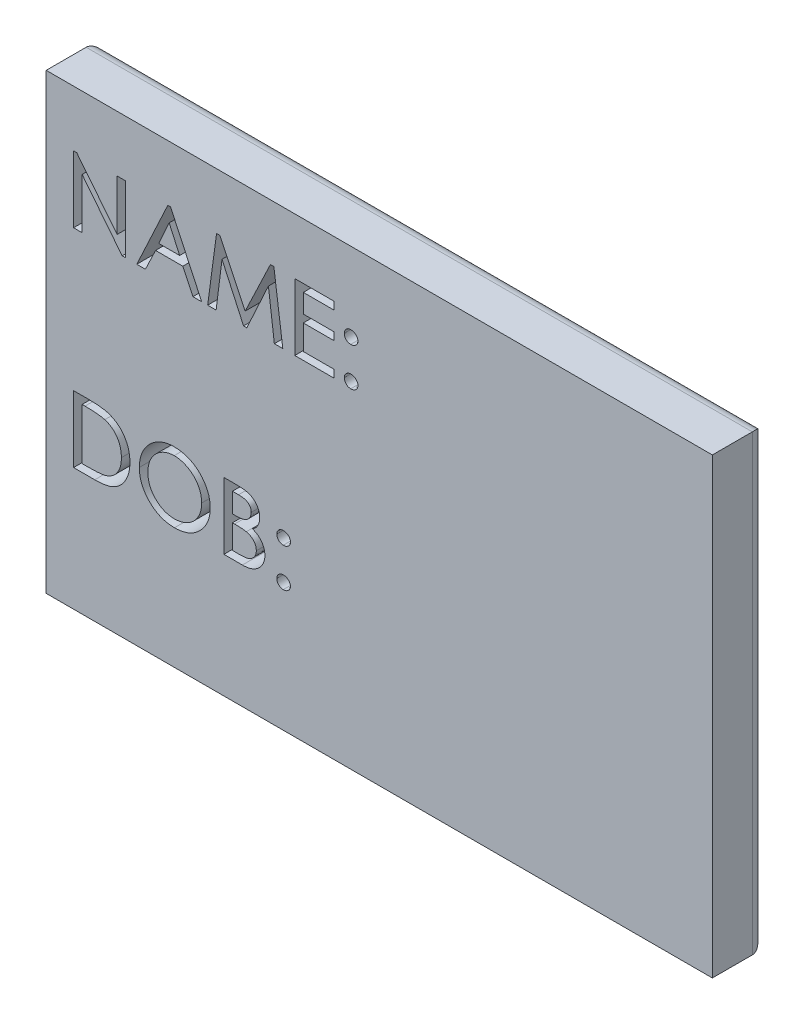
from build123d import *

# Parameters (mm, degrees)
SKETCH1_W           = 31.75
SKETCH1_H           = 21.59
BOSS_EXTRUDE1_DEPTH = 2.54
FILLET1_R           = 0.635
CUT_EXTRUDE1_DEPTH  = 1.905


with BuildPart() as part:
    # Sketch1 → Boss-Extrude1 (new body)
    with BuildSketch(Plane.XY):
        Rectangle(SKETCH1_W, SKETCH1_H)
    extrude(amount=BOSS_EXTRUDE1_DEPTH)

    # Fillet1
    fillet1_edges = [part.edges().sort_by_distance(p)[0] for p in [
        (0, -10.795, 0),
        (-15.875, 0, 0),
        (0, 10.795, 0),
        (15.875, 0, 0),
    ]]
    fillet(fillet1_edges, radius=FILLET1_R)

    # Sketch2 → Cut-Extrude1 (cut)
    # profile 1 of 11: a face of its own
    with BuildSketch(Plane.XY.offset(2.54)):
        Polygon((-14.569923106, 4.948487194), (-14.569923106, 8.123487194), (-14.419186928, 8.123487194), (-12.493961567, 5.71107233), (-12.493961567, 8.123487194), (-12.086910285, 8.123487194), (-12.086910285, 4.948487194), (-12.253546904, 4.948487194), (-14.162871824, 7.354541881), (-14.162871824, 4.948487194), align=None)
    # profile 2 of 11: a face of its own
    with BuildSketch(Plane.XY.offset(2.54)):
        Polygon((-9.949891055, 8.123487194), (-8.464153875, 4.948487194), (-8.882017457, 4.948487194), (-9.364118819, 5.966115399), (-10.662866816, 5.966115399), (-11.144968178, 4.948487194), (-11.557743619, 4.948487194), (-10.07709458, 8.123487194), align=None)
        Polygon((-10.013492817, 7.429591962), (-10.507678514, 6.332461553), (-9.514218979, 6.332461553), align=None, mode=Mode.SUBTRACT)
    # profile 3 of 11: a face of its own
    with BuildSketch(Plane.XY.offset(2.54)):
        Polygon((-8.179217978, 4.948487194), (-7.75499422, 8.123487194), (-7.594717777, 8.123487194), (-6.390736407, 5.599769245), (-5.186755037, 8.123487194), (-5.023934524, 8.123487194), (-4.597166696, 4.948487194), (-5.001037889, 4.948487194), (-5.283429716, 7.187269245), (-6.313778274, 4.948487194), (-6.46769454, 4.948487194), (-7.49486301, 7.187269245), (-7.775982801, 4.948487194), align=None)
    # profile 4 of 11: a face of its own
    with BuildSketch(Plane.XY.offset(2.54)):
        Polygon((-4.027294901, 8.123487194), (-2.154859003, 8.123487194), (-2.154859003, 7.75714104), (-3.620243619, 7.75714104), (-3.620243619, 6.86162822), (-2.154859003, 6.86162822), (-2.154859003, 6.495282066), (-3.620243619, 6.495282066), (-3.620243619, 5.314833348), (-2.154859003, 5.314833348), (-2.154859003, 4.948487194), (-4.027294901, 4.948487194), align=None)
    # profile 5 of 11: a face of its own
    with BuildSketch(Plane.XY.offset(2.54)):
        with BuildLine():
            add(Edge.make_bspline(
                [(-1.361109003, 7.350089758), (-1.336395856, 7.349143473), (-1.288805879, 7.347321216), (-1.221230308, 7.329025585), (-1.161048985, 7.29863509), (-1.110610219, 7.256408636), (-1.06831818, 7.208780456), (-1.038288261, 7.156509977), (-1.017953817, 7.10180968), (-1.016063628, 7.063845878), (-1.015115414, 7.044801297)],
                knots=[0, 0, 0, 0, 1.15701891, 2.228065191, 3.255424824, 4.294461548, 5.295444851, 6.226722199, 7.110433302, 8, 8, 8, 8], degree=3))
            add(Edge.make_bspline(
                [(-1.015115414, 7.044801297), (-1.016102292, 7.025773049), (-1.018079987, 6.987640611), (-1.03792385, 6.932691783), (-1.068780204, 6.880739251), (-1.110133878, 6.832503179), (-1.161316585, 6.791070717), (-1.221189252, 6.760531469), (-1.288817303, 6.742294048), (-1.336399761, 6.740463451), (-1.361109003, 6.739512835)],
                knots=[0, 0, 0, 0, 0.88933384, 1.782217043, 2.704665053, 3.712913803, 4.745427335, 5.772518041, 6.843283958, 8, 8, 8, 8], degree=3))
            add(Edge.make_bspline(
                [(-1.361109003, 6.739512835), (-1.381579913, 6.740605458), (-1.421735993, 6.742748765), (-1.479333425, 6.75990848), (-1.532199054, 6.787879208), (-1.57846636, 6.82657043), (-1.61765397, 6.872784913), (-1.645959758, 6.925646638), (-1.663213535, 6.983747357), (-1.665318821, 7.024117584), (-1.666397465, 7.044801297)],
                knots=[0, 0, 0, 0, 1.02157714, 2.003942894, 2.975565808, 3.991633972, 4.999549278, 5.985507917, 6.967873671, 8, 8, 8, 8], degree=3))
            add(Edge.make_bspline(
                [(-1.666397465, 7.044801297), (-1.665272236, 7.065049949), (-1.663053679, 7.104973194), (-1.646145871, 7.162578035), (-1.617273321, 7.215083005), (-1.578533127, 7.261743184), (-1.532115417, 7.301216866), (-1.479160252, 7.329507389), (-1.421548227, 7.346929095), (-1.38158531, 7.349018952), (-1.361109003, 7.350089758)],
                knots=[0, 0, 0, 0, 1.012462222, 1.996220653, 2.974240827, 3.991749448, 5.016039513, 6.003395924, 6.976974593, 8, 8, 8, 8], degree=3))
        make_face()
    # profile 6 of 11: a face of its own
    with BuildSketch(Plane.XY.offset(2.54)):
        with BuildLine():
            add(Edge.make_bspline(
                [(-1.361109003, 5.518358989), (-1.336395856, 5.517412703), (-1.288805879, 5.515590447), (-1.221230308, 5.497294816), (-1.161048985, 5.466904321), (-1.110610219, 5.424677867), (-1.06831818, 5.377049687), (-1.038288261, 5.324779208), (-1.017953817, 5.270078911), (-1.016063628, 5.232115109), (-1.015115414, 5.213070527)],
                knots=[0, 0, 0, 0, 1.15701891, 2.228065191, 3.255424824, 4.294461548, 5.295444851, 6.226722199, 7.110433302, 8, 8, 8, 8], degree=3))
            add(Edge.make_bspline(
                [(-1.015115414, 5.213070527), (-1.016149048, 5.194264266), (-1.018217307, 5.156633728), (-1.037439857, 5.101843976), (-1.067934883, 5.049692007), (-1.109745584, 5.001523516), (-1.160264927, 4.95909108), (-1.221052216, 4.929680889), (-1.288480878, 4.910368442), (-1.336373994, 4.90866291), (-1.361109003, 4.907782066)],
                knots=[0, 0, 0, 0, 0.879435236, 1.759712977, 2.690738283, 3.698978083, 4.737733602, 5.760330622, 6.843294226, 8, 8, 8, 8], degree=3))
            add(Edge.make_bspline(
                [(-1.361109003, 4.907782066), (-1.381570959, 4.908890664), (-1.421709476, 4.91106531), (-1.479531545, 4.928026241), (-1.531989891, 4.956936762), (-1.578725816, 4.995439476), (-1.617462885, 5.042289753), (-1.645847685, 5.094992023), (-1.66322822, 5.152638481), (-1.665323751, 5.192596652), (-1.666397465, 5.213070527)],
                knots=[0, 0, 0, 0, 1.022542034, 2.005835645, 2.98339371, 4.000421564, 5.017449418, 6.004339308, 6.977457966, 8, 8, 8, 8], degree=3))
            add(Edge.make_bspline(
                [(-1.666397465, 5.213070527), (-1.665309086, 5.233748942), (-1.6631848, 5.274108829), (-1.646121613, 5.332103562), (-1.617439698, 5.384540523), (-1.578505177, 5.430702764), (-1.531917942, 5.469447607), (-1.479180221, 5.497803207), (-1.421542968, 5.515191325), (-1.381583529, 5.517285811), (-1.361109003, 5.518358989)],
                knots=[0, 0, 0, 0, 1.03279153, 2.015790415, 2.993055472, 4.001620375, 5.018343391, 6.004937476, 6.977764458, 8, 8, 8, 8], degree=3))
        make_face()
    # profile 7 of 11: a face of its own
    with BuildSketch(Plane.XY.offset(2.54)):
        with BuildLine():
            Line((-14.569923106, -4.948487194), (-14.569923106, -1.773487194))
            Line((-14.569923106, -1.773487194), (-13.897652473, -1.773487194))
            add(Edge.make_bspline(
                [(-13.897652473, -1.773487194), (-13.841042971, -1.773881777), (-13.732040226, -1.774641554), (-13.574460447, -1.779624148), (-13.429136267, -1.78819181), (-13.295756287, -1.801105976), (-13.17445451, -1.816294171), (-13.065269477, -1.836387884), (-12.967783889, -1.858048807), (-12.908089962, -1.877968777), (-12.880024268, -1.887334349)],
                knots=[0, 0, 0, 0, 1.321377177, 2.544338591, 3.679698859, 4.71869479, 5.671952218, 6.531967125, 7.309789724, 8, 8, 8, 8], degree=3))
            add(Edge.make_bspline(
                [(-12.880024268, -1.887334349), (-12.840729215, -1.902141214), (-12.76317101, -1.93136611), (-12.653281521, -1.986225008), (-12.549462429, -2.046411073), (-12.453007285, -2.114729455), (-12.36410028, -2.190749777), (-12.281215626, -2.272811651), (-12.206910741, -2.363307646), (-12.138847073, -2.459683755), (-12.078539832, -2.562051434), (-12.026338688, -2.669066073), (-11.982250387, -2.780522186), (-11.945991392, -2.896136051), (-11.918202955, -3.016115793), (-11.897668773, -3.140134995), (-11.885399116, -3.268514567), (-11.88406177, -3.355660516), (-11.883384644, -3.399784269)],
                knots=[0, 0, 0, 0, 1.037989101, 2.048720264, 3.03347809, 4.003905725, 4.967380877, 5.923996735, 6.884742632, 7.859453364, 8.839691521, 9.819957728, 10.801471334, 11.80152298, 12.813966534, 13.844978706, 14.908869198, 16, 16, 16, 16], degree=3))
            add(Edge.make_bspline(
                [(-11.883384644, -3.399784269), (-11.883976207, -3.437966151), (-11.885144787, -3.513391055), (-11.895029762, -3.625097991), (-11.910673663, -3.73366983), (-11.933034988, -3.839036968), (-11.961626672, -3.941050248), (-11.996851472, -4.039996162), (-12.037915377, -4.136000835), (-12.085789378, -4.22797069), (-12.138266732, -4.315629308), (-12.195639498, -4.397714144), (-12.256764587, -4.474252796), (-12.321782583, -4.5452529), (-12.391298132, -4.610338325), (-12.465220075, -4.669459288), (-12.543111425, -4.723220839), (-12.625725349, -4.771252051), (-12.714605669, -4.813955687), (-12.811390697, -4.84979798), (-12.916271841, -4.880115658), (-13.029144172, -4.905892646), (-13.150600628, -4.924243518), (-13.280039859, -4.938132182), (-13.41753503, -4.94748052), (-13.511997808, -4.948145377), (-13.56056313, -4.948487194)],
                knots=[0, 0, 0, 0, 1.058131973, 2.090245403, 3.105765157, 4.096918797, 5.07359586, 6.040054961, 7.006085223, 7.965371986, 8.911666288, 9.835956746, 10.738988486, 11.624821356, 12.502036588, 13.375701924, 14.24610047, 15.122941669, 16.021834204, 16.975760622, 17.979893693, 19.046217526, 20.182340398, 21.382202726, 22.654134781, 24, 24, 24, 24], degree=3))
            Line((-13.56056313, -4.948487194), (-14.569923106, -4.948487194))
        make_face()
        with BuildLine():
            Line((-14.162871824, -4.58214104), (-13.886840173, -4.58214104))
            add(Edge.make_bspline(
                [(-13.886840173, -4.58214104), (-13.835954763, -4.581945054), (-13.738196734, -4.581568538), (-13.597632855, -4.577394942), (-13.46927143, -4.57241175), (-13.353524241, -4.563159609), (-13.250137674, -4.552833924), (-13.159109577, -4.539491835), (-13.080067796, -4.524488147), (-13.032371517, -4.510398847), (-13.010407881, -4.503910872)],
                knots=[0, 0, 0, 0, 1.383618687, 2.658126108, 3.823786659, 4.876093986, 5.815132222, 6.648351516, 7.377580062, 8, 8, 8, 8], degree=3))
            add(Edge.make_bspline(
                [(-13.010407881, -4.503910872), (-12.983106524, -4.494150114), (-12.929177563, -4.474869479), (-12.851903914, -4.438991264), (-12.779076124, -4.397605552), (-12.710938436, -4.350339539), (-12.646915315, -4.297814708), (-12.586955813, -4.240090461), (-12.53212613, -4.175979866), (-12.482087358, -4.106757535), (-12.436746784, -4.032894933), (-12.397338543, -3.954633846), (-12.364004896, -3.872132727), (-12.337689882, -3.785591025), (-12.316422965, -3.695118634), (-12.301290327, -3.600550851), (-12.292359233, -3.50171937), (-12.291084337, -3.434571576), (-12.290435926, -3.400420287)],
                knots=[0, 0, 0, 0, 0.982760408, 1.941267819, 2.884666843, 3.819923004, 4.749609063, 5.690155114, 6.638335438, 7.60609908, 8.583824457, 9.574050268, 10.573936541, 11.597196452, 12.638231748, 13.723193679, 14.842018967, 16, 16, 16, 16], degree=3))
            add(Edge.make_bspline(
                [(-12.290435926, -3.400420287), (-12.290946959, -3.364561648), (-12.291953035, -3.293966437), (-12.302871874, -3.190163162), (-12.318132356, -3.090137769), (-12.34111674, -2.994186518), (-12.371402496, -2.902607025), (-12.406546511, -2.814362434), (-12.449672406, -2.7308125), (-12.498447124, -2.651416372), (-12.552938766, -2.577001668), (-12.613170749, -2.508704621), (-12.678031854, -2.44579875), (-12.749093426, -2.390181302), (-12.824339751, -2.339201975), (-12.905317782, -2.295725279), (-12.991143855, -2.257554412), (-13.051135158, -2.237700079), (-13.081641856, -2.22760378)],
                knots=[0, 0, 0, 0, 1.129217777, 2.223100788, 3.284889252, 4.31516385, 5.326848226, 6.321524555, 7.304244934, 8.284784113, 9.254596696, 10.205833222, 11.15055266, 12.096616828, 13.045035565, 14.010353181, 14.988227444, 16, 16, 16, 16], degree=3))
            add(Edge.make_bspline(
                [(-13.081641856, -2.22760378), (-13.107431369, -2.220509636), (-13.162213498, -2.205440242), (-13.251504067, -2.188040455), (-13.352121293, -2.173124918), (-13.46453048, -2.160341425), (-13.588220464, -2.151012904), (-13.72376755, -2.145168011), (-13.870692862, -2.140257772), (-13.972697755, -2.139978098), (-14.025492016, -2.139833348)],
                knots=[0, 0, 0, 0, 0.675026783, 1.433893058, 2.294494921, 3.24250292, 4.28921909, 5.425097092, 6.667317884, 8, 8, 8, 8], degree=3))
            Line((-14.025492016, -2.139833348), (-14.162871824, -2.139833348))
            Line((-14.162871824, -2.139833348), (-14.162871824, -4.58214104))
        make_face(mode=Mode.SUBTRACT)
    # profile 8 of 11: a face of its own
    with BuildSketch(Plane.XY.offset(2.54)):
        with BuildLine():
            add(Edge.make_bspline(
                [(-9.786434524, -1.692076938), (-9.725513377, -1.693483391), (-9.605771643, -1.696247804), (-9.430111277, -1.719817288), (-9.262361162, -1.757523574), (-9.10276873, -1.8113816), (-8.951226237, -1.880390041), (-8.807494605, -1.96468152), (-8.672000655, -2.064511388), (-8.546400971, -2.178599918), (-8.432309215, -2.302876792), (-8.33119947, -2.434245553), (-8.247239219, -2.573287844), (-8.177052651, -2.71799164), (-8.123945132, -2.86969937), (-8.08459815, -3.027125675), (-8.061392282, -3.191325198), (-8.058546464, -3.303036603), (-8.057102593, -3.359715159)],
                knots=[0, 0, 0, 0, 1.090651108, 2.14369656, 3.167927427, 4.165692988, 5.154576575, 6.145033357, 7.14440862, 8.163220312, 9.178978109, 10.162394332, 11.12677451, 12.082874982, 13.037579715, 13.999894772, 14.985214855, 16, 16, 16, 16], degree=3))
            add(Edge.make_bspline(
                [(-8.057102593, -3.359715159), (-8.058518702, -3.415976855), (-8.061309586, -3.526858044), (-8.084961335, -3.690056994), (-8.123091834, -3.847292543), (-8.176490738, -3.998870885), (-8.246540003, -4.143635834), (-8.33092017, -4.282801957), (-8.431421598, -4.415039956), (-8.545087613, -4.540186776), (-8.669998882, -4.654684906), (-8.804120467, -4.755239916), (-8.945825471, -4.839875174), (-9.094407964, -4.910330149), (-9.251083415, -4.963225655), (-9.414681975, -5.002449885), (-9.585847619, -5.025624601), (-9.702410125, -5.028457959), (-9.761629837, -5.02989745)],
                knots=[0, 0, 0, 0, 1.015667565, 2.001689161, 2.971180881, 3.933912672, 4.898051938, 5.870540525, 6.8683264, 7.892867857, 8.919988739, 9.923897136, 10.914753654, 11.896185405, 12.887840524, 13.895451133, 14.930781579, 16, 16, 16, 16], degree=3))
            add(Edge.make_bspline(
                [(-9.761629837, -5.02989745), (-9.819377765, -5.028501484), (-9.933008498, -5.025754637), (-10.099706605, -5.001960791), (-10.259639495, -4.964867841), (-10.412600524, -4.911558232), (-10.558832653, -4.843562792), (-10.697502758, -4.759216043), (-10.829836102, -4.660978), (-10.953315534, -4.548437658), (-11.066007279, -4.425199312), (-11.164855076, -4.294016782), (-11.248925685, -4.156558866), (-11.317315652, -4.012668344), (-11.370593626, -3.862208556), (-11.407552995, -3.705215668), (-11.43147955, -3.542137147), (-11.434231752, -3.431246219), (-11.435628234, -3.374979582)],
                knots=[0, 0, 0, 0, 1.056734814, 2.079339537, 3.076314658, 4.058285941, 5.039336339, 6.023146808, 7.024524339, 8.052147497, 9.076900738, 10.077495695, 11.054668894, 12.021676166, 12.988994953, 13.970866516, 14.970407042, 16, 16, 16, 16], degree=3))
            add(Edge.make_bspline(
                [(-11.435628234, -3.374979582), (-11.43514369, -3.337212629), (-11.434180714, -3.262155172), (-11.422570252, -3.150700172), (-11.405756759, -3.041025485), (-11.381533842, -2.933500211), (-11.350290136, -2.828105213), (-11.311780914, -2.725061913), (-11.267673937, -2.62349939), (-11.215064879, -2.525433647), (-11.157946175, -2.430295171), (-11.094474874, -2.340639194), (-11.027336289, -2.255373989), (-10.953703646, -2.176775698), (-10.876038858, -2.102540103), (-10.793072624, -2.033812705), (-10.705313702, -1.969972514), (-10.612383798, -1.91244122), (-10.516572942, -1.860408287), (-10.417806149, -1.815757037), (-10.317424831, -1.777433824), (-10.214958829, -1.746372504), (-10.110680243, -1.721850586), (-10.004361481, -1.705152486), (-9.896087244, -1.693518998), (-9.823142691, -1.692559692), (-9.786434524, -1.692076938)],
                knots=[0, 0, 0, 0, 1.036913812, 2.060746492, 3.074578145, 4.08324605, 5.085523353, 6.091481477, 7.103103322, 8.124200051, 9.145827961, 10.149052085, 11.139400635, 12.124186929, 13.104469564, 14.088618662, 15.081002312, 16.082788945, 17.088477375, 18.073521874, 19.057670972, 20.037642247, 21.012252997, 21.997331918, 22.992189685, 24, 24, 24, 24], degree=3))
        make_face()
        with BuildLine():
            add(Edge.make_bspline(
                [(-9.773078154, -2.058423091), (-9.799814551, -2.058846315), (-9.85299384, -2.059688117), (-9.932216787, -2.06849962), (-10.010619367, -2.081735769), (-10.08833738, -2.100351), (-10.165434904, -2.123611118), (-10.241248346, -2.153367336), (-10.316510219, -2.187413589), (-10.389878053, -2.227771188), (-10.461399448, -2.271579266), (-10.529048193, -2.320485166), (-10.593600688, -2.372470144), (-10.654126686, -2.429285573), (-10.710512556, -2.490187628), (-10.763071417, -2.555076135), (-10.812204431, -2.623726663), (-10.856835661, -2.696615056), (-10.898057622, -2.772232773), (-10.932757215, -2.851069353), (-10.962150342, -2.93228599), (-10.986274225, -3.015797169), (-11.005602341, -3.101768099), (-11.018533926, -3.19023065), (-11.027373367, -3.281093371), (-11.028171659, -3.342520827), (-11.028576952, -3.373707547)],
                knots=[0, 0, 0, 0, 0.951425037, 1.892405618, 2.834142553, 3.780555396, 4.735506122, 5.698386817, 6.677778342, 7.674036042, 8.677244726, 9.661625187, 10.643485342, 11.625954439, 12.613944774, 13.595804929, 14.596853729, 15.616869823, 16.636634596, 17.660413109, 18.67984269, 19.709280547, 20.753005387, 21.813969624, 22.890152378, 24, 24, 24, 24], degree=3))
            add(Edge.make_bspline(
                [(-11.028576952, -3.373707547), (-11.027592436, -3.41914166), (-11.025661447, -3.508254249), (-11.00703893, -3.638965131), (-10.978167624, -3.763868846), (-10.937301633, -3.882838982), (-10.88468233, -3.995839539), (-10.820280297, -4.102837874), (-10.743987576, -4.204102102), (-10.65671435, -4.297686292), (-10.562101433, -4.383196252), (-10.461745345, -4.457708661), (-10.357943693, -4.522141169), (-10.249030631, -4.5737858), (-10.136073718, -4.614033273), (-10.018881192, -4.642672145), (-9.897431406, -4.660379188), (-9.814903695, -4.662484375), (-9.773078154, -4.663551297)],
                knots=[0, 0, 0, 0, 1.087324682, 2.132633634, 3.154656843, 4.153212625, 5.138884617, 6.133989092, 7.13811672, 8.169089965, 9.193543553, 10.187520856, 11.158295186, 12.114249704, 13.068004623, 14.02467326, 14.998892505, 16, 16, 16, 16], degree=3))
            add(Edge.make_bspline(
                [(-9.773078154, -4.663551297), (-9.743376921, -4.663126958), (-9.684492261, -4.662285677), (-9.597202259, -4.653597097), (-9.511639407, -4.640200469), (-9.42775329, -4.62216637), (-9.345793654, -4.597293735), (-9.265142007, -4.568679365), (-9.186683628, -4.532994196), (-9.109854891, -4.493516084), (-9.036617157, -4.448114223), (-8.966145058, -4.399848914), (-8.899862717, -4.347332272), (-8.839041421, -4.289514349), (-8.781201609, -4.229014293), (-8.727913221, -4.164134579), (-8.678803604, -4.095298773), (-8.634365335, -4.022727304), (-8.594505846, -3.947289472), (-8.559077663, -3.869544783), (-8.530281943, -3.789378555), (-8.505572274, -3.707574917), (-8.487353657, -3.62329901), (-8.474180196, -3.537060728), (-8.465385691, -3.448726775), (-8.464567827, -3.38920524), (-8.464153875, -3.359079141)],
                knots=[0, 0, 0, 0, 1.036970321, 2.055862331, 3.060095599, 4.060719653, 5.049301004, 6.049377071, 7.046955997, 8.056986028, 9.063944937, 10.053856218, 11.039021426, 12.013303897, 12.982198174, 13.960523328, 14.942567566, 15.933032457, 16.929951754, 17.920776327, 18.913894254, 19.902475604, 20.903099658, 21.921964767, 22.948227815, 24, 24, 24, 24], degree=3))
            add(Edge.make_bspline(
                [(-8.464153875, -3.359079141), (-8.464569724, -3.329165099), (-8.465391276, -3.27006682), (-8.474136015, -3.182573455), (-8.487338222, -3.097390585), (-8.50568493, -3.01420919), (-8.530156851, -2.933393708), (-8.559100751, -2.854325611), (-8.594507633, -2.777846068), (-8.634389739, -2.703692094), (-8.678914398, -2.632083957), (-8.728593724, -2.564364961), (-8.782062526, -2.499751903), (-8.840112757, -2.439196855), (-8.902782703, -2.38247915), (-8.969477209, -2.329173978), (-9.040397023, -2.279075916), (-9.115717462, -2.233959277), (-9.193427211, -2.192504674), (-9.273112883, -2.157152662), (-9.353396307, -2.126212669), (-9.43501773, -2.101356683), (-9.517961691, -2.082404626), (-9.602022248, -2.068264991), (-9.687250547, -2.059765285), (-9.744438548, -2.058870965), (-9.773078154, -2.058423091)],
                knots=[0, 0, 0, 0, 1.048789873, 2.071992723, 3.080474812, 4.070813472, 5.056451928, 6.039816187, 7.021295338, 8.009314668, 8.991328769, 9.975844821, 10.952581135, 11.930703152, 12.91499457, 13.914777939, 14.923479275, 15.957618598, 16.991998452, 18.010408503, 19.012925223, 20.00783076, 20.999814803, 21.994803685, 22.995802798, 24, 24, 24, 24], degree=3))
        make_face(mode=Mode.SUBTRACT)
    # profile 9 of 11: a face of its own
    with BuildSketch(Plane.XY.offset(2.54)):
        with BuildLine():
            Line((-7.405820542, -1.773487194), (-6.760898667, -1.773487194))
            add(Edge.make_bspline(
                [(-6.760898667, -1.773487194), (-6.72930101, -1.773595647), (-6.667968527, -1.773806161), (-6.578675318, -1.779314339), (-6.494686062, -1.786896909), (-6.415781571, -1.796451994), (-6.342475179, -1.810897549), (-6.274360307, -1.826972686), (-6.211631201, -1.846717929), (-6.136306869, -1.87696629), (-6.050155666, -1.921566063), (-5.958840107, -1.988557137), (-5.879420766, -2.066987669), (-5.813728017, -2.156603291), (-5.76175875, -2.253820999), (-5.723574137, -2.355944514), (-5.700727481, -2.462346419), (-5.697717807, -2.534692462), (-5.696205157, -2.5710533)],
                knots=[0, 0, 0, 0, 1.007958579, 1.956493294, 2.853051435, 3.69876748, 4.490758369, 5.235590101, 5.930857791, 6.586533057, 7.824014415, 9.014592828, 10.186442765, 11.371570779, 12.545761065, 13.692928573, 14.840474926, 16, 16, 16, 16], degree=3))
            add(Edge.make_bspline(
                [(-5.696205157, -2.5710533), (-5.697503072, -2.605049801), (-5.700068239, -2.672239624), (-5.718294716, -2.771303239), (-5.74888654, -2.866450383), (-5.791581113, -2.956194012), (-5.843168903, -3.03905937), (-5.906748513, -3.109654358), (-5.978225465, -3.16979045), (-6.032704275, -3.198861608), (-6.06000724, -3.213431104)],
                knots=[0, 0, 0, 0, 1.049068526, 2.073352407, 3.097740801, 4.125217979, 5.134529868, 6.0985968, 7.047080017, 8, 8, 8, 8], degree=3))
            add(Edge.make_bspline(
                [(-6.06000724, -3.213431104), (-6.027526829, -3.224215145), (-5.964330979, -3.245197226), (-5.875832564, -3.287067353), (-5.795707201, -3.335895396), (-5.724741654, -3.392989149), (-5.662537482, -3.456331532), (-5.607087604, -3.524147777), (-5.559813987, -3.597495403), (-5.521382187, -3.676082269), (-5.489680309, -3.757798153), (-5.468540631, -3.843112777), (-5.45441023, -3.930600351), (-5.452791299, -3.989952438), (-5.451974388, -4.019901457)],
                knots=[0, 0, 0, 0, 1.133419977, 2.205250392, 3.236826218, 4.236512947, 5.215313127, 6.174419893, 7.135300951, 8.100002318, 9.069604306, 10.034177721, 11.008047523, 12, 12, 12, 12], degree=3))
            add(Edge.make_bspline(
                [(-5.451974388, -4.019901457), (-5.452825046, -4.05089832), (-5.45450534, -4.112125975), (-5.468030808, -4.202421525), (-5.491342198, -4.289171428), (-5.522312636, -4.373260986), (-5.563538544, -4.453633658), (-5.613400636, -4.530966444), (-5.672377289, -4.604916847), (-5.739229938, -4.675184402), (-5.814153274, -4.739543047), (-5.896355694, -4.795495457), (-5.985065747, -4.842958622), (-6.080265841, -4.881972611), (-6.18249919, -4.911492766), (-6.290970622, -4.933186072), (-6.405910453, -4.945901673), (-6.484623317, -4.947611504), (-6.524936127, -4.948487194)],
                knots=[0, 0, 0, 0, 0.936774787, 1.85039767, 2.752028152, 3.648404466, 4.554125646, 5.47676296, 6.425627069, 7.40928418, 8.404729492, 9.405524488, 10.409085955, 11.440939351, 12.509690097, 13.620780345, 14.781482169, 16, 16, 16, 16], degree=3))
            Line((-6.524936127, -4.948487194), (-7.405820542, -4.948487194))
            Line((-7.405820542, -4.948487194), (-7.405820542, -1.773487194))
        make_face()
        with BuildLine():
            Line((-6.99876926, -2.139833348), (-6.99876926, -3.076051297))
            Line((-6.99876926, -3.076051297), (-6.896370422, -3.076051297))
            add(Edge.make_bspline(
                [(-6.896370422, -3.076051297), (-6.869864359, -3.076071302), (-6.818950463, -3.07610973), (-6.745384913, -3.072450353), (-6.677485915, -3.068358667), (-6.615080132, -3.062130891), (-6.55849394, -3.053682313), (-6.507137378, -3.04463325), (-6.461760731, -3.032508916), (-6.409102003, -3.014972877), (-6.350847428, -2.98712282), (-6.288059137, -2.946137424), (-6.233328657, -2.896545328), (-6.187207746, -2.83924941), (-6.149357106, -2.776511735), (-6.122701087, -2.709230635), (-6.105869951, -2.638660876), (-6.104136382, -2.59044107), (-6.103256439, -2.565965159)],
                knots=[0, 0, 0, 0, 1.189795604, 2.285406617, 3.306016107, 4.243629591, 5.09972607, 5.874440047, 6.583200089, 7.20625147, 8.364329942, 9.470433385, 10.562068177, 11.665054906, 12.761988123, 13.838370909, 14.902777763, 16, 16, 16, 16], degree=3))
            add(Edge.make_bspline(
                [(-6.103256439, -2.565965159), (-6.103483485, -2.549819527), (-6.103927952, -2.518212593), (-6.111463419, -2.472491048), (-6.121952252, -2.4289988), (-6.138032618, -2.388600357), (-6.157869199, -2.350524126), (-6.182203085, -2.315060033), (-6.211789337, -2.282915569), (-6.24497277, -2.252497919), (-6.283511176, -2.225485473), (-6.327843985, -2.202973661), (-6.37726263, -2.182800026), (-6.432667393, -2.167565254), (-6.49355577, -2.154531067), (-6.560136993, -2.146003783), (-6.632344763, -2.140987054), (-6.682235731, -2.140227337), (-6.708109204, -2.139833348)],
                knots=[0, 0, 0, 0, 0.920588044, 1.802157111, 2.638793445, 3.470424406, 4.277107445, 5.086238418, 5.917516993, 6.765890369, 7.652348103, 8.594329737, 9.598999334, 10.694623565, 11.869668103, 13.151790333, 14.522917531, 16, 16, 16, 16], degree=3))
            Line((-6.708109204, -2.139833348), (-6.99876926, -2.139833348))
        make_face(mode=Mode.SUBTRACT)
        with BuildLine():
            Line((-6.99876926, -3.44239745), (-6.99876926, -4.58214104))
            Line((-6.99876926, -4.58214104), (-6.687120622, -4.58214104))
            add(Edge.make_bspline(
                [(-6.687120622, -4.58214104), (-6.659771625, -4.581784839), (-6.606970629, -4.581097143), (-6.530793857, -4.579010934), (-6.460381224, -4.573730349), (-6.395879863, -4.566889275), (-6.336966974, -4.558343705), (-6.284447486, -4.546656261), (-6.237252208, -4.534310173), (-6.182932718, -4.514140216), (-6.122139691, -4.482858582), (-6.056038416, -4.437547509), (-5.998648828, -4.382107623), (-5.949249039, -4.319405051), (-5.909032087, -4.251030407), (-5.880401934, -4.178719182), (-5.862235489, -4.103897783), (-5.860099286, -4.053075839), (-5.85902567, -4.027533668)],
                knots=[0, 0, 0, 0, 1.163785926, 2.246848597, 3.241725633, 4.167152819, 5.00659376, 5.772700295, 6.455464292, 7.08048881, 8.234268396, 9.355318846, 10.478218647, 11.615125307, 12.742977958, 13.840148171, 14.914498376, 16, 16, 16, 16], degree=3))
            add(Edge.make_bspline(
                [(-5.85902567, -4.027533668), (-5.860301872, -3.995560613), (-5.862808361, -3.932764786), (-5.888358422, -3.842330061), (-5.92831627, -3.758043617), (-5.984086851, -3.681099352), (-6.053721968, -3.612605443), (-6.136897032, -3.555688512), (-6.232415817, -3.510673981), (-6.301564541, -3.490821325), (-6.337310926, -3.480558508)],
                knots=[0, 0, 0, 0, 0.973192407, 1.911372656, 2.842841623, 3.806662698, 4.794486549, 5.808057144, 6.866876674, 8, 8, 8, 8], degree=3))
            add(Edge.make_bspline(
                [(-6.337310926, -3.480558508), (-6.352121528, -3.477421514), (-6.383920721, -3.47068621), (-6.43581339, -3.463598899), (-6.494687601, -3.456192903), (-6.561167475, -3.451784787), (-6.634904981, -3.446794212), (-6.716162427, -3.444923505), (-6.804771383, -3.442641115), (-6.866263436, -3.442480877), (-6.898278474, -3.44239745)],
                knots=[0, 0, 0, 0, 0.644909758, 1.384657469, 2.230684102, 3.173004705, 4.222865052, 5.379792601, 6.635823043, 8, 8, 8, 8], degree=3))
            Line((-6.898278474, -3.44239745), (-6.99876926, -3.44239745))
        make_face(mode=Mode.SUBTRACT)
    # profile 10 of 11: a face of its own
    with BuildSketch(Plane.XY.offset(2.54)):
        with BuildLine():
            add(Edge.make_bspline(
                [(-4.576814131, -2.54688463), (-4.552100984, -2.547830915), (-4.504511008, -2.549653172), (-4.436935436, -2.567948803), (-4.376754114, -2.598339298), (-4.326315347, -2.640565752), (-4.284023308, -2.688193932), (-4.25399339, -2.74046441), (-4.233658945, -2.795164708), (-4.231768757, -2.83312851), (-4.230820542, -2.852173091)],
                knots=[0, 0, 0, 0, 1.15701891, 2.228065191, 3.255424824, 4.294461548, 5.295444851, 6.226722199, 7.110433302, 8, 8, 8, 8], degree=3))
            add(Edge.make_bspline(
                [(-4.230820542, -2.852173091), (-4.23180742, -2.871201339), (-4.233785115, -2.909333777), (-4.253628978, -2.964282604), (-4.284485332, -3.016235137), (-4.325839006, -3.064471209), (-4.377021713, -3.10590367), (-4.43689438, -3.136442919), (-4.504522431, -3.15468034), (-4.552104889, -3.156510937), (-4.576814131, -3.157461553)],
                knots=[0, 0, 0, 0, 0.88933384, 1.782217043, 2.704665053, 3.712913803, 4.745427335, 5.772518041, 6.843283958, 8, 8, 8, 8], degree=3))
            add(Edge.make_bspline(
                [(-4.576814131, -3.157461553), (-4.597285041, -3.15636893), (-4.637441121, -3.154225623), (-4.695038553, -3.137065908), (-4.747904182, -3.10909518), (-4.794171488, -3.070403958), (-4.833359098, -3.024189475), (-4.861664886, -2.97132775), (-4.878918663, -2.913227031), (-4.881023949, -2.872856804), (-4.882102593, -2.852173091)],
                knots=[0, 0, 0, 0, 1.02157714, 2.003942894, 2.975565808, 3.991633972, 4.999549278, 5.985507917, 6.967873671, 8, 8, 8, 8], degree=3))
            add(Edge.make_bspline(
                [(-4.882102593, -2.852173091), (-4.880977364, -2.831924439), (-4.878758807, -2.792001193), (-4.861850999, -2.734396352), (-4.832978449, -2.681891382), (-4.794238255, -2.635231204), (-4.747820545, -2.595757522), (-4.69486538, -2.567466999), (-4.637253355, -2.550045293), (-4.597290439, -2.547955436), (-4.576814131, -2.54688463)],
                knots=[0, 0, 0, 0, 1.012462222, 1.996220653, 2.974240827, 3.991749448, 5.016039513, 6.003395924, 6.976974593, 8, 8, 8, 8], degree=3))
        make_face()
    # profile 11 of 11: a face of its own
    with BuildSketch(Plane.XY.offset(2.54)):
        with BuildLine():
            add(Edge.make_bspline(
                [(-4.576814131, -4.378615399), (-4.552100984, -4.379561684), (-4.504511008, -4.381383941), (-4.436935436, -4.399679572), (-4.376754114, -4.430070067), (-4.326315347, -4.472296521), (-4.284023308, -4.519924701), (-4.25399339, -4.57219518), (-4.233658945, -4.626895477), (-4.231768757, -4.664859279), (-4.230820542, -4.683903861)],
                knots=[0, 0, 0, 0, 1.15701891, 2.228065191, 3.255424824, 4.294461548, 5.295444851, 6.226722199, 7.110433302, 8, 8, 8, 8], degree=3))
            add(Edge.make_bspline(
                [(-4.230820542, -4.683903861), (-4.231854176, -4.702710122), (-4.233922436, -4.74034066), (-4.253144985, -4.795130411), (-4.283640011, -4.847282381), (-4.325450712, -4.895450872), (-4.375970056, -4.937883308), (-4.436757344, -4.967293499), (-4.504186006, -4.986605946), (-4.552079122, -4.988311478), (-4.576814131, -4.989192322)],
                knots=[0, 0, 0, 0, 0.879435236, 1.759712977, 2.690738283, 3.698978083, 4.737733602, 5.760330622, 6.843294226, 8, 8, 8, 8], degree=3))
            add(Edge.make_bspline(
                [(-4.576814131, -4.989192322), (-4.597276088, -4.988083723), (-4.637414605, -4.985909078), (-4.695236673, -4.968948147), (-4.747695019, -4.940037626), (-4.794430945, -4.901534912), (-4.833168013, -4.854684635), (-4.861552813, -4.801982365), (-4.878933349, -4.744335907), (-4.881028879, -4.704377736), (-4.882102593, -4.683903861)],
                knots=[0, 0, 0, 0, 1.022542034, 2.005835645, 2.98339371, 4.000421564, 5.017449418, 6.004339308, 6.977457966, 8, 8, 8, 8], degree=3))
            add(Edge.make_bspline(
                [(-4.882102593, -4.683903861), (-4.881014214, -4.663225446), (-4.878889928, -4.622865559), (-4.861826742, -4.564870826), (-4.833144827, -4.512433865), (-4.794210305, -4.466271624), (-4.74762307, -4.427526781), (-4.694885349, -4.399171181), (-4.637248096, -4.381783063), (-4.597288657, -4.379688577), (-4.576814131, -4.378615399)],
                knots=[0, 0, 0, 0, 1.03279153, 2.015790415, 2.993055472, 4.001620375, 5.018343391, 6.004937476, 6.977764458, 8, 8, 8, 8], degree=3))
        make_face()
    extrude(amount=-CUT_EXTRUDE1_DEPTH, mode=Mode.SUBTRACT)


solid = part.part
